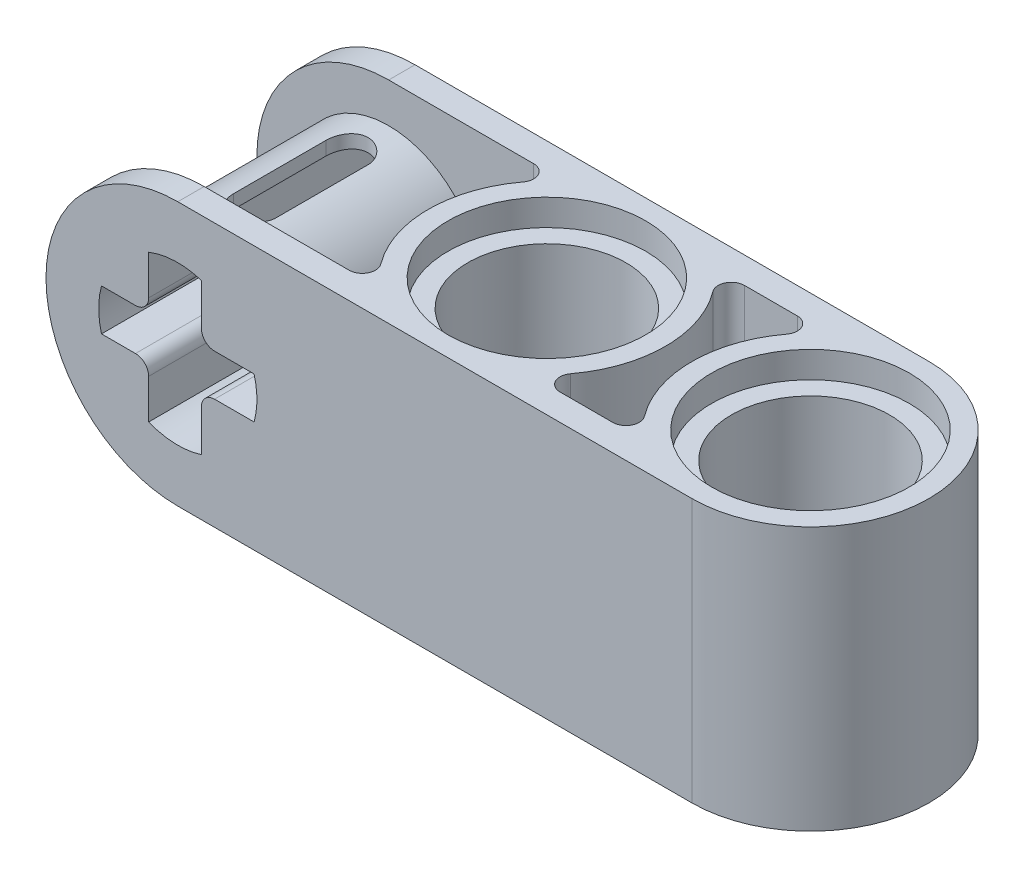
from build123d import *

# Parameters (mm, degrees)
EXTRUDE_1_DEPTH          = 4
CUT_EXTRUDE_1_DEPTH      = 13.787493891
CUT_EXTRUDE_1_DEPTH_BACK = 13.787493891
SKETCH_2_R               = 2.4
SKETCH_3_R               = 3
CUT_EXTRUDE_2_DEPTH      = 0.8
SKETCH_4_R               = 4
EXTRUDE_2_DEPTH          = 3.6
CUT_EXTRUDE_3_DEPTH      = 13.787494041
CUT_EXTRUDE_3_DEPTH_BACK = 13.787494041
CUT_EXTRUDE_5_DEPTH      = 3.2
SKETCH_8_R               = 2.8
EXTRUDE_3_DEPTH          = 3.6
CUT_EXTRUDE_4_DEPTH      = 13.787494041
CUT_EXTRUDE_4_DEPTH_BACK = 13.787494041
CUT_EXTRUDE_6_DEPTH      = 13.787494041
CUT_EXTRUDE_6_DEPTH_BACK = 13.787494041
FILLET_1_R               = 0.4
CUT_EXTRUDE_8_DEPTH      = 2.8


with BuildPart() as part:
    # Sketch 1 → Extrude 1 (new, symmetric)
    with BuildSketch(Plane(origin=(0, 0, 0), x_dir=(1, 0, 0), z_dir=(0, 1, 0))):
        with BuildLine():
            Line((-8, -3.6), (8, -3.6))
            ThreePointArc((8, -3.6), (11.6, 0), (8, 3.6))
            Line((8, 3.6), (-8, 3.6))
            ThreePointArc((-8, 3.6), (-11.6, 0), (-8, -3.6))
        make_face()
    extrude(amount=EXTRUDE_1_DEPTH, both=True)

    # Sketch 2 → Cut-Extrude 1 (cut, two sides: drawn at the far end of the back side and taken through both)
    with BuildSketch(Plane(origin=(0, 0, 0), x_dir=(1, 0, 0), z_dir=(0, 1, 0)).offset(-CUT_EXTRUDE_1_DEPTH_BACK)):
        with Locations(Location((0, 0, 0), (0, 0, 270))):
            Circle(SKETCH_2_R)
        with Locations(Location((8, 0, 0), (0, 0, 270))):
            Circle(SKETCH_2_R)
    extrude(amount=CUT_EXTRUDE_1_DEPTH + CUT_EXTRUDE_1_DEPTH_BACK, mode=Mode.SUBTRACT)

    # Sketch 3 → Cut-Extrude 2 (cut)
    with BuildSketch(Plane(origin=(0, 4, 0), x_dir=(1, 0, 0), z_dir=(0, 1, 0))):
        with Locations(Location((0, 0, 0), (0, 0, 270))):
            Circle(SKETCH_3_R)
        with Locations(Location((8, 0, 0), (0, 0, 270))):
            Circle(SKETCH_3_R)
    cut_extrude_2 = extrude(amount=-CUT_EXTRUDE_2_DEPTH, mode=Mode.SUBTRACT)

    # Sketch 4 → Extrude 2 (add, symmetric)
    with BuildSketch(Plane.XY):
        with Locations((-7.6, 0)):
            Circle(SKETCH_4_R)
    extrude(amount=EXTRUDE_2_DEPTH, both=True)

    # Sketch 5 → Cut-Extrude 3 (cut, two sides: drawn at the far end of the back side and taken through both)
    with BuildSketch(Plane.XY.offset(-CUT_EXTRUDE_3_DEPTH_BACK)):
        with BuildLine():
            ThreePointArc((-11.6, 0), (-10.428427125, 2.828427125), (-7.6, 4))
            Line((-7.6, 4), (-11.6, 4))
            Line((-11.6, 4), (-11.6, 0))
        make_face()
        with BuildLine():
            ThreePointArc((-7.6, -4), (-10.428427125, -2.828427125), (-11.6, 0))
            Line((-11.6, 0), (-11.6, -4))
            Line((-11.6, -4), (-7.6, -4))
        make_face()
    extrude(amount=CUT_EXTRUDE_3_DEPTH + CUT_EXTRUDE_3_DEPTH_BACK, mode=Mode.SUBTRACT)

    # Sketch 7 → Cut-Extrude 5 (cut)
    with BuildSketch(Plane(origin=(0, 4, 0), x_dir=(1, 0, 0), z_dir=(0, 1, 0))):
        with BuildLine():
            Line((4.8, 2.8), (3.2, 2.8))
            ThreePointArc((3.2, 2.8), (2.842229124, 2.578885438), (2.88, 2.16))
            ThreePointArc((2.88, 2.16), (3.6, 0), (2.88, -2.16))
            ThreePointArc((2.88, -2.16), (2.842229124, -2.578885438), (3.2, -2.8))
            Line((3.2, -2.8), (4.8, -2.8))
            ThreePointArc((4.8, -2.8), (5.157770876, -2.578885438), (5.12, -2.16))
            ThreePointArc((5.12, -2.16), (4.4, 0), (5.12, 2.16))
            ThreePointArc((5.12, 2.16), (5.157770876, 2.578885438), (4.8, 2.8))
        make_face()
        with BuildLine():
            Line((-3.2, 2.8), (-11.6, 2.8))
            Line((-11.6, 2.8), (-11.6, -2.8))
            Line((-11.6, -2.8), (-3.2, -2.8))
            ThreePointArc((-3.2, -2.8), (-2.842229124, -2.578885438), (-2.88, -2.16))
            ThreePointArc((-2.88, -2.16), (-3.6, 0), (-2.88, 2.16))
            ThreePointArc((-2.88, 2.16), (-2.842229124, 2.578885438), (-3.2, 2.8))
        make_face()
    cut_extrude_5 = extrude(amount=-CUT_EXTRUDE_5_DEPTH, mode=Mode.SUBTRACT)

    # Mirror 1: Cut-Extrude 2, Cut-Extrude 5 across plane
    add(cut_extrude_2.mirror(Plane.ZX), mode=Mode.SUBTRACT)
    add(cut_extrude_5.mirror(Plane.ZX), mode=Mode.SUBTRACT)

    # Sketch 8 → Extrude 3 (add, symmetric)
    with BuildSketch(Plane.XY):
        with Locations((-7.6, 0)):
            Circle(SKETCH_8_R)
    extrude(amount=EXTRUDE_3_DEPTH, both=True)

    # Sketch 6 → Cut-Extrude 4 (cut, two sides: drawn at the far end of the back side and taken through both)
    with BuildSketch(Plane.XY.offset(-CUT_EXTRUDE_4_DEPTH_BACK)):
        with BuildLine():
            Line((-6.884458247, 0.631083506), (-5.284458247, 0.631083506))
            ThreePointArc((-5.284458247, 0.631083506), (-5.2, 0), (-5.284458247, -0.631083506))
            Line((-5.284458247, -0.631083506), (-6.884458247, -0.631083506))
            Line((-6.884458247, -0.631083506), (-6.884458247, -2.29085137))
            ThreePointArc((-6.884458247, -2.29085137), (-7.689589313, -2.398327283), (-8.484458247, -2.231083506))
            Line((-8.484458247, -2.231083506), (-8.484458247, -0.631083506))
            Line((-8.484458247, -0.631083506), (-9.915541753, -0.631083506))
            ThreePointArc((-9.915541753, -0.631083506), (-10, 0), (-9.915541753, 0.631083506))
            Line((-9.915541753, 0.631083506), (-8.484458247, 0.631083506))
            Line((-8.484458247, 0.631083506), (-8.484458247, 2.231083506))
            ThreePointArc((-8.484458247, 2.231083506), (-7.689589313, 2.398327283), (-6.884458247, 2.29085137))
            Line((-6.884458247, 2.29085137), (-6.884458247, 0.631083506))
        make_face()
    extrude(amount=CUT_EXTRUDE_4_DEPTH + CUT_EXTRUDE_4_DEPTH_BACK, mode=Mode.SUBTRACT)

    # Sketch 9 → Cut-Extrude 6 (cut, two sides: drawn at the far end of the back side and taken through both)
    with BuildSketch(Plane(origin=(0, 0, 0), x_dir=(1, 0, 0), z_dir=(0, 1, 0)).offset(-CUT_EXTRUDE_6_DEPTH_BACK)):
        with BuildLine():
            Line((-8.24, -1.264820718), (-8.24, 1.535179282))
            ThreePointArc((-8.24, 1.535179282), (-7.6, 2.175179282), (-6.96, 1.535179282))
            Line((-6.96, 1.535179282), (-6.96, -1.264820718))
            ThreePointArc((-6.96, -1.264820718), (-7.6, -1.904820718), (-8.24, -1.264820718))
        make_face()
    extrude(amount=CUT_EXTRUDE_6_DEPTH + CUT_EXTRUDE_6_DEPTH_BACK, mode=Mode.SUBTRACT)

    # Fillet 1
    fillet_1_edges = [part.edges().sort_by_distance(p)[0] for p in [
        (-8.484458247, 0.631083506, 0),
        (-6.884458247, 0.631083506, 0),
        (-6.884458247, -0.631083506, 0),
        (-8.484458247, -0.631083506, 0),
    ]]
    fillet(fillet_1_edges, radius=FILLET_1_R)

    # Sketch 11 → Cut-Extrude 8 (cut, symmetric)
    with BuildSketch(Plane.XY):
        with BuildLine():
            Line((-11.446062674, -1.099000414), (-10.175305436, -1.099000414))
            ThreePointArc((-10.175305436, -1.099000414), (-10.399988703, 0.007953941), (-10.169020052, 1.113613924))
            Line((-10.169020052, 1.113613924), (-11.441856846, 1.113613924))
            ThreePointArc((-11.441856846, 1.113613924), (-11.599992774, 0.007603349), (-11.446062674, -1.099000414))
        make_face()
    extrude(amount=CUT_EXTRUDE_8_DEPTH, both=True, mode=Mode.SUBTRACT)


solid = part.part
